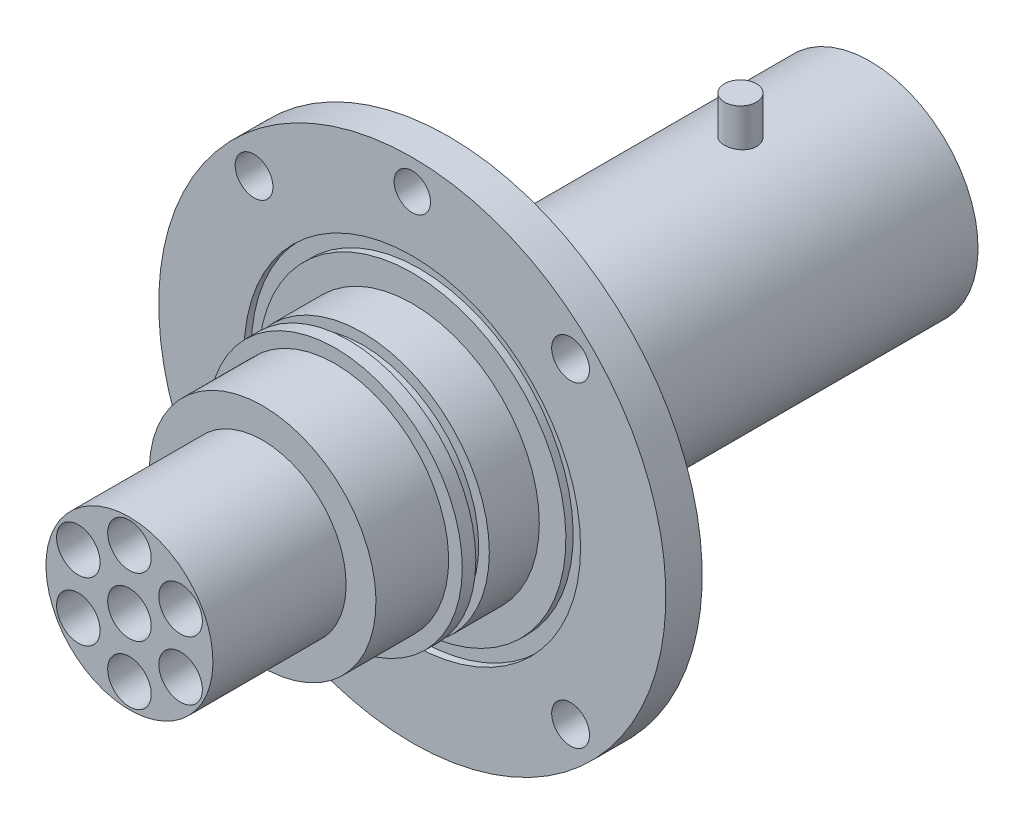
from build123d import *

# Parameters (mm, degrees)
SKETCH2_R                = 3.175
SKETCH2_R_2              = 3.302
CUT_EXTRUDE1_DEPTH       = 102.639838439
BOSS_EXTRUDE2_START      = 15.875
SKETCH7_R                = 2.794
BOSS_EXTRUDE2_DEPTH      = 9.525
BOSS_EXTRUDE1_DEPTH      = 73.025
BOSS_EXTRUDE1_DEPTH_BACK = 55.5625
SKETCH6_R                = 14.592747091
SKETCH6_R_2              = 3.806225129


with BuildPart() as part:
    # Sketch1 → Revolve1 (revolve)
    with BuildSketch(Plane(origin=(0, 0, 0), x_dir=(0, 0, -1), z_dir=(1, 0, 0))):
        Polygon((0, 22.1996), (0, 26.8478), (1.27, 26.8478), (1.27, 29.4132), (0, 29.4132), (0, 44.323), (6.35, 44.323), (6.35, 27.94), (14.6812, 27.94), (14.6812, 18.8722), (80.01, 18.8722), (80.01, 14.592747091), (6.126988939, 14.592747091), (6.126988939, 0), (0, 0), (-26.162, 0), (-26.162, 19.812), (-13.462, 19.812), (-13.462, 22.1996), (-11.0998, 22.1996), (-11.0998, 20.335679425), (-8.7376, 20.335679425), (-8.7376, 22.1996), align=None)
    revolve(axis=Axis((0, 0, 0), (0, 0, 1)))

    # Sketch2 → Cut-Extrude1 (cut, through all)
    with BuildSketch(Plane.XY):
        with Locations((0, 39.116)):
            Circle(SKETCH2_R)
        with Locations((27.659188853, 27.659188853)):
            Circle(SKETCH2_R_2)
        with Locations((27.660188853, -27.658188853)):
            Circle(SKETCH2_R_2)
        with Locations((-27.657188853, -27.659188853)):
            Circle(SKETCH2_R_2)
        with Locations((-27.658188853, 27.658188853)):
            Circle(SKETCH2_R_2)
    extrude(amount=-CUT_EXTRUDE1_DEPTH, mode=Mode.SUBTRACT)

    # Sketch7 → Boss-Extrude2 (add)
    with BuildSketch(Plane(origin=(0, 0, 0), x_dir=(1, 0, 0), z_dir=(0, 1, 0)).offset(BOSS_EXTRUDE2_START)):
        with Locations(Location((0, 57.3532, 0), (0, 0, 270))):
            Circle(SKETCH7_R)
    extrude(amount=BOSS_EXTRUDE2_DEPTH)

    # Sketch6 → Boss-Extrude1 (add, two sides: drawn at the far end of the back side and taken through both)
    with BuildSketch(Plane(origin=(0, 0, -6.126988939), x_dir=(-1, 0, 0), z_dir=(0, 0, -1)).offset(-BOSS_EXTRUDE1_DEPTH_BACK)):
        with Locations(Location((0, 0, 0), (0, 0, 90))):
            Circle(SKETCH6_R)
        with Locations(Location((0, 0, 0), (0, 0, 90))):
            Circle(SKETCH6_R_2, mode=Mode.SUBTRACT)
        with Locations(Location((0, 10.31875, 0), (0, 0, 90))):
            Circle(SKETCH6_R_2, mode=Mode.SUBTRACT)
        with Locations(Location((8.936299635, 5.159375, 0), (0, 0, 90))):
            Circle(SKETCH6_R_2, mode=Mode.SUBTRACT)
        with Locations(Location((8.936299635, -5.159375, 0), (0, 0, 90))):
            Circle(SKETCH6_R_2, mode=Mode.SUBTRACT)
        with Locations(Location((0, -10.31875, 0), (0, 0, 90))):
            Circle(SKETCH6_R_2, mode=Mode.SUBTRACT)
        with Locations(Location((-8.936299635, -5.159375, 0), (0, 0, 90))):
            Circle(SKETCH6_R_2, mode=Mode.SUBTRACT)
        with Locations(Location((-8.936299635, 5.159375, 0), (0, 0, 90))):
            Circle(SKETCH6_R_2, mode=Mode.SUBTRACT)
    extrude(amount=BOSS_EXTRUDE1_DEPTH + BOSS_EXTRUDE1_DEPTH_BACK)


solid = part.part
